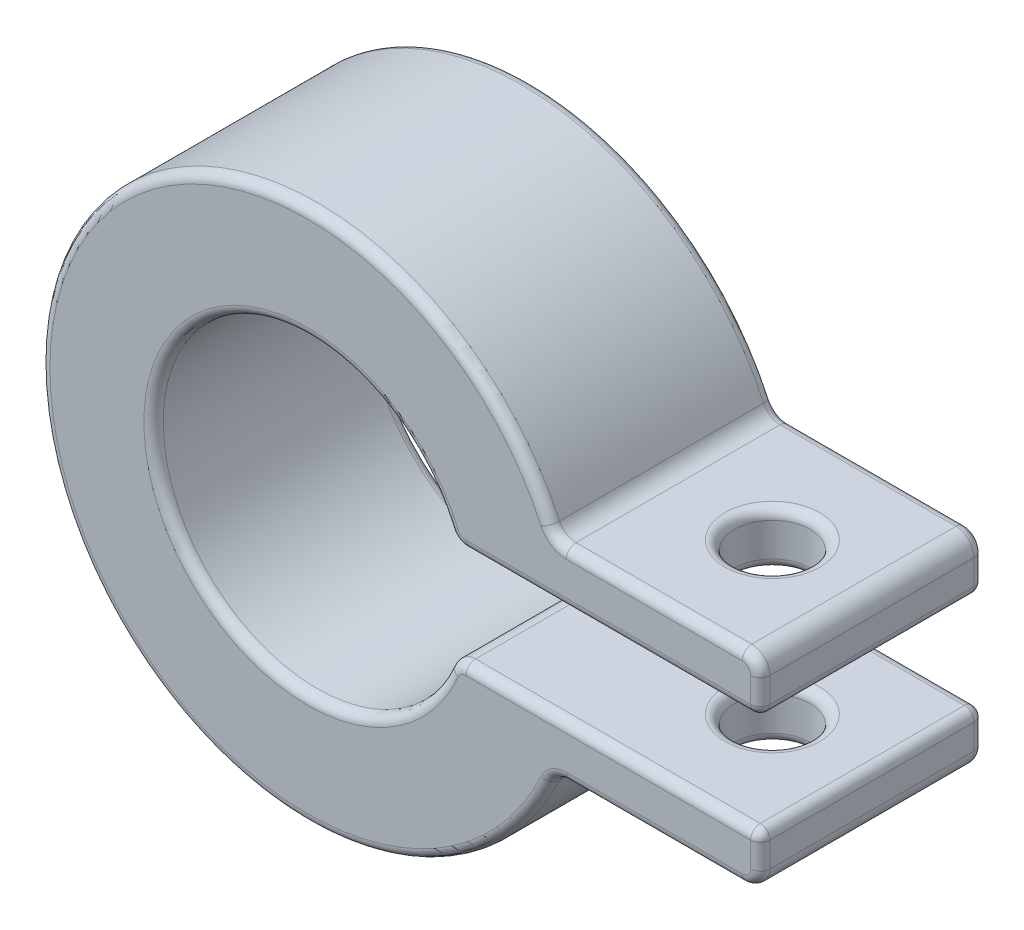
from build123d import *

# Parameters (mm, degrees)
EXTRUDE1_DEPTH     = 9.398
SKETCH4_R          = 3.175
CUT_EXTRUDE1_DEPTH = 197.738546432
FILLET1_R          = 0.8128


with BuildPart() as part:
    # Sketch3 → Extrude1 (new, symmetric)
    with BuildSketch(Plane.XY.offset(181.102)):
        with BuildLine():
            Line((13.329404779, -4.1275), (38.1, -4.1275))
            Line((38.1, -4.1275), (38.1, -7.0485))
            ThreePointArc((38.1, -7.0485), (37.653630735, -8.126130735), (36.576, -8.5725))
            Line((36.576, -8.5725), (21.776241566, -8.5725))
            ThreePointArc((21.776241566, -8.5725), (20.955991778, -8.812067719), (20.393623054, -9.455452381))
            ThreePointArc((20.393623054, -9.455452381), (-22.479, 0), (20.393623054, 9.455452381))
            ThreePointArc((20.393623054, 9.455452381), (20.955991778, 8.812067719), (21.776241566, 8.5725))
            Line((21.776241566, 8.5725), (36.576, 8.5725))
            ThreePointArc((36.576, 8.5725), (37.653630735, 8.126130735), (38.1, 7.0485))
            Line((38.1, 7.0485), (38.1, 4.1275))
            Line((38.1, 4.1275), (13.329404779, 4.1275))
            ThreePointArc((13.329404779, 4.1275), (12.487990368, 4.380831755), (11.926309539, 5.056605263))
            ThreePointArc((11.926309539, 5.056605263), (-12.954, 0), (11.926309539, -5.056605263))
            ThreePointArc((11.926309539, -5.056605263), (12.487990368, -4.380831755), (13.329404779, -4.1275))
        make_face()
    extrude(amount=EXTRUDE1_DEPTH, both=True)

    # Sketch4 → Cut-Extrude1 (cut, through all)
    with BuildSketch(Plane.XZ.offset(8.5725)):
        with Locations(Location((29.845, 181.229, 0), (0, 0, 270))):
            Circle(SKETCH4_R)
    extrude(amount=-CUT_EXTRUDE1_DEPTH, mode=Mode.SUBTRACT)

    # Fillet1
    fillet1_edges = [part.edges().sort_by_distance(p)[0] for p in [
        (25.714702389, -4.1275, 190.5),
        (29.176120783, -8.5725, 171.704),
        (20.955991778, -8.812067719, 171.704),
        (-22.479, 0, 171.704),
        (20.955991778, 8.812067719, 171.704),
        (29.176120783, 8.5725, 171.704),
        (12.487990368, -4.380831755, 190.5),
        (37.653630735, 8.126130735, 171.704),
        (38.1, 5.588, 171.704),
        (25.714702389, 4.1275, 171.704),
        (12.487990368, 4.380831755, 171.704),
        (-12.954, 0, 171.704),
        (12.487990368, -4.380831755, 171.704),
        (25.714702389, -4.1275, 171.704),
        (38.1, -5.588, 171.704),
        (-12.954, 0, 190.5),
        (37.653630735, -8.126130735, 171.704),
        (12.487990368, 4.380831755, 190.5),
        (38.1, 4.1275, 181.102),
        (25.714702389, 4.1275, 190.5),
        (38.1, -4.1275, 181.102),
        (38.1, 5.588, 190.5),
        (37.653630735, 8.126130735, 190.5),
        (29.176120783, 8.5725, 190.5),
        (20.955991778, 8.812067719, 190.5),
        (-22.479, 0, 190.5),
        (29.845, -4.1275, 184.404),
        (29.845, 8.5725, 184.404),
        (29.845, 4.1275, 184.404),
        (29.845, -8.5725, 184.404),
        (37.653630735, -8.126130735, 190.5),
        (20.955991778, -8.812067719, 190.5),
        (29.176120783, -8.5725, 190.5),
        (38.1, -5.588, 190.5),
    ]]
    fillet(fillet1_edges, radius=FILLET1_R)


solid = part.part
